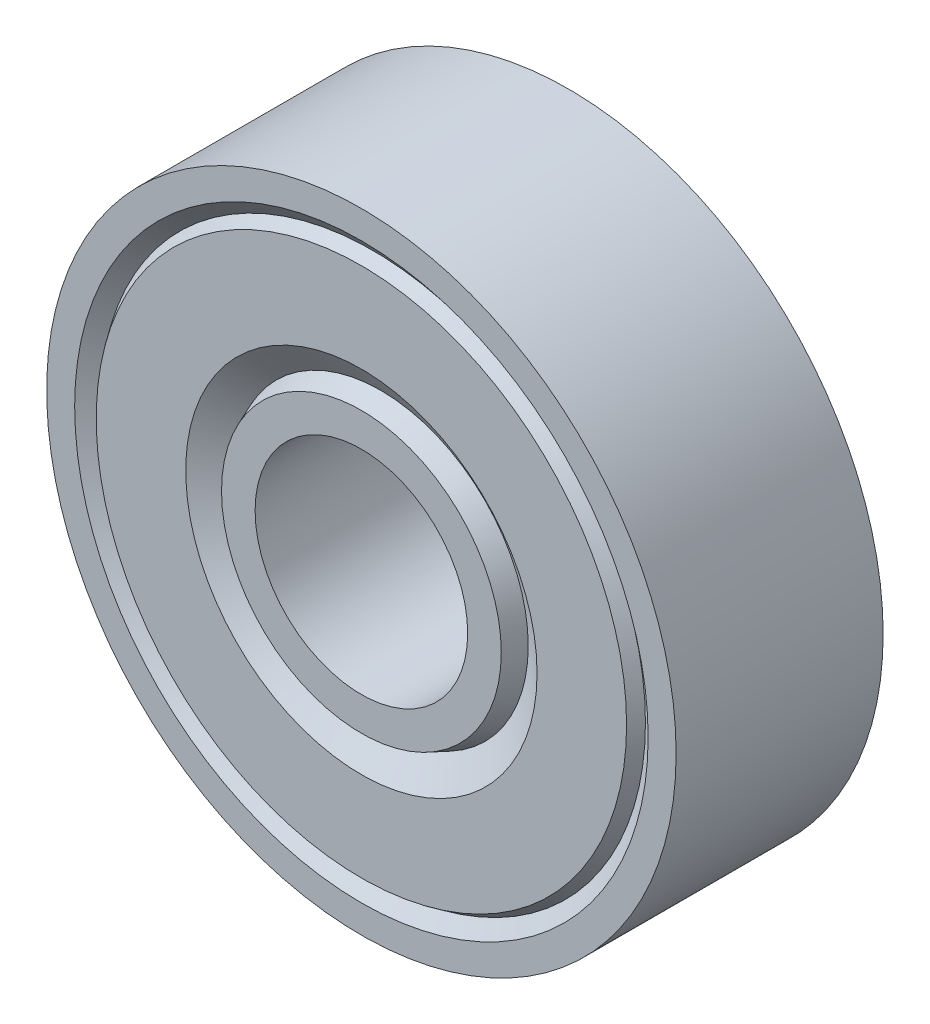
ISO-10303-21;
HEADER;
FILE_DESCRIPTION(('STEP AP214'),'2;1');
FILE_NAME('part.step','',(''),(''),'','','');
FILE_SCHEMA(('AUTOMOTIVE_DESIGN { 1 0 10303 214 1 1 1 1 }'));
ENDSEC;
DATA;
#1=APPLICATION_CONTEXT('core data for automotive mechanical design processes');
#2=APPLICATION_PROTOCOL_DEFINITION('international standard','automotive_design',2000,#1);
#3=PRODUCT_CONTEXT('',#1,'mechanical');
#4=PRODUCT('Part','Part','',(#3));
#5=PRODUCT_RELATED_PRODUCT_CATEGORY('part','',(#4));
#6=PRODUCT_DEFINITION_FORMATION('','',#4);
#7=PRODUCT_DEFINITION_CONTEXT('part definition',#1,'design');
#8=PRODUCT_DEFINITION('design','',#6,#7);
#9=PRODUCT_DEFINITION_SHAPE('','',#8);
#10=(LENGTH_UNIT() NAMED_UNIT(*) SI_UNIT(.MILLI.,.METRE.));
#11=(NAMED_UNIT(*) PLANE_ANGLE_UNIT() SI_UNIT($,.RADIAN.));
#12=(NAMED_UNIT(*) SI_UNIT($,.STERADIAN.) SOLID_ANGLE_UNIT());
#13=UNCERTAINTY_MEASURE_WITH_UNIT(LENGTH_MEASURE(1.E-05),#10,'distance_accuracy_value','');
#14=(GEOMETRIC_REPRESENTATION_CONTEXT(3) GLOBAL_UNCERTAINTY_ASSIGNED_CONTEXT((#13)) GLOBAL_UNIT_ASSIGNED_CONTEXT((#10,
#11,#12)) REPRESENTATION_CONTEXT('',''));
#15=CARTESIAN_POINT('',(0.,0.,0.));
#16=DIRECTION('',(0.,0.,1.));
#17=DIRECTION('',(1.,0.,0.));
#18=AXIS2_PLACEMENT_3D('',#15,#16,#17);
#19=CARTESIAN_POINT('',(0.,0.,0.));
#20=DIRECTION('',(0.,0.,1.));
#21=DIRECTION('',(1.,0.,0.));
#22=AXIS2_PLACEMENT_3D('',#19,#20,#21);
#23=CYLINDRICAL_SURFACE('',#22,4.8259999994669);
#24=CARTESIAN_POINT('',(0.,0.,-4.69899999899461));
#25=DIRECTION('',(0.,0.,1.));
#26=DIRECTION('',(1.,0.,0.));
#27=AXIS2_PLACEMENT_3D('',#24,#25,#26);
#28=CIRCLE('',#27,4.8259999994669);
#29=CARTESIAN_POINT('',(4.8259999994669,0.,-4.69899999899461));
#30=VERTEX_POINT('',#29);
#31=EDGE_CURVE('E82',#30,#30,#28,.T.);
#32=ORIENTED_EDGE('',*,*,#31,.F.);
#33=EDGE_LOOP('',(#32));
#34=FACE_BOUND('',#33,.T.);
#35=CARTESIAN_POINT('',(0.,0.,4.69899999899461));
#36=DIRECTION('',(0.,0.,1.));
#37=DIRECTION('',(1.,0.,0.));
#38=AXIS2_PLACEMENT_3D('',#35,#36,#37);
#39=CIRCLE('',#38,4.8259999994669);
#40=CARTESIAN_POINT('',(4.8259999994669,0.,4.69899999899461));
#41=VERTEX_POINT('',#40);
#42=EDGE_CURVE('E10',#41,#41,#39,.T.);
#43=ORIENTED_EDGE('',*,*,#42,.T.);
#44=EDGE_LOOP('',(#43));
#45=FACE_BOUND('',#44,.T.);
#46=ADVANCED_FACE('F30',(#34,#45),#23,.F.);
#47=CARTESIAN_POINT('',(-6.35000000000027,0.,4.69899999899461));
#48=DIRECTION('',(0.,0.,-1.));
#49=DIRECTION('',(-1.,0.,0.));
#50=AXIS2_PLACEMENT_3D('',#47,#48,#49);
#51=PLANE('',#50);
#52=ORIENTED_EDGE('',*,*,#42,.F.);
#53=EDGE_LOOP('',(#52));
#54=FACE_BOUND('',#53,.T.);
#55=CARTESIAN_POINT('',(0.,0.,4.69899999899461));
#56=DIRECTION('',(0.,0.,1.));
#57=DIRECTION('',(1.,0.,0.));
#58=AXIS2_PLACEMENT_3D('',#55,#56,#57);
#59=CIRCLE('',#58,6.35000000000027);
#60=CARTESIAN_POINT('',(6.35000000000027,0.,4.69899999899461));
#61=VERTEX_POINT('',#60);
#62=EDGE_CURVE('E36',#61,#61,#59,.T.);
#63=ORIENTED_EDGE('',*,*,#62,.T.);
#64=EDGE_LOOP('',(#63));
#65=FACE_BOUND('',#64,.T.);
#66=ADVANCED_FACE('F89',(#54,#65),#51,.F.);
#67=CARTESIAN_POINT('',(0.,0.,3.825839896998));
#68=DIRECTION('',(0.,0.,-1.));
#69=DIRECTION('',(-1.,0.,0.));
#70=AXIS2_PLACEMENT_3D('',#67,#68,#69);
#71=CONICAL_SURFACE('',#70,6.70136220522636,0.382576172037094);
#72=ORIENTED_EDGE('',*,*,#62,.F.);
#73=EDGE_LOOP('',(#72));
#74=FACE_BOUND('',#73,.T.);
#75=CARTESIAN_POINT('',(0.,0.,3.825839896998));
#76=DIRECTION('',(0.,0.,1.));
#77=DIRECTION('',(1.,0.,0.));
#78=AXIS2_PLACEMENT_3D('',#75,#76,#77);
#79=CIRCLE('',#78,6.70136220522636);
#80=CARTESIAN_POINT('',(6.70136220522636,0.,3.825839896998));
#81=VERTEX_POINT('',#80);
#82=EDGE_CURVE('E40',#81,#81,#79,.T.);
#83=ORIENTED_EDGE('',*,*,#82,.T.);
#84=EDGE_LOOP('',(#83));
#85=FACE_BOUND('',#84,.T.);
#86=ADVANCED_FACE('F93',(#74,#85),#71,.T.);
#87=CARTESIAN_POINT('',(0.,0.,4.69899999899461));
#88=DIRECTION('',(0.,0.,1.));
#89=DIRECTION('',(1.,0.,0.));
#90=AXIS2_PLACEMENT_3D('',#87,#88,#89);
#91=CONICAL_SURFACE('',#90,7.97467252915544,0.969704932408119);
#92=ORIENTED_EDGE('',*,*,#82,.F.);
#93=EDGE_LOOP('',(#92));
#94=FACE_BOUND('',#93,.T.);
#95=CARTESIAN_POINT('',(0.,0.,4.69899999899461));
#96=DIRECTION('',(0.,0.,1.));
#97=DIRECTION('',(1.,0.,0.));
#98=AXIS2_PLACEMENT_3D('',#95,#96,#97);
#99=CIRCLE('',#98,7.97467252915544);
#100=CARTESIAN_POINT('',(7.97467252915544,0.,4.69899999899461));
#101=VERTEX_POINT('',#100);
#102=EDGE_CURVE('E44',#101,#101,#99,.T.);
#103=ORIENTED_EDGE('',*,*,#102,.T.);
#104=EDGE_LOOP('',(#103));
#105=FACE_BOUND('',#104,.T.);
#106=ADVANCED_FACE('F98',(#94,#105),#91,.F.);
#107=CARTESIAN_POINT('',(-12.0386725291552,0.,4.69899999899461));
#108=DIRECTION('',(0.,0.,-1.));
#109=DIRECTION('',(-1.,0.,0.));
#110=AXIS2_PLACEMENT_3D('',#107,#108,#109);
#111=PLANE('',#110);
#112=ORIENTED_EDGE('',*,*,#102,.F.);
#113=EDGE_LOOP('',(#112));
#114=FACE_BOUND('',#113,.T.);
#115=CARTESIAN_POINT('',(0.,0.,4.69899999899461));
#116=DIRECTION('',(0.,0.,1.));
#117=DIRECTION('',(1.,0.,0.));
#118=AXIS2_PLACEMENT_3D('',#115,#116,#117);
#119=CIRCLE('',#118,12.0386725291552);
#120=CARTESIAN_POINT('',(12.0386725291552,0.,4.69899999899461));
#121=VERTEX_POINT('',#120);
#122=EDGE_CURVE('E49',#121,#121,#119,.T.);
#123=ORIENTED_EDGE('',*,*,#122,.T.);
#124=EDGE_LOOP('',(#123));
#125=FACE_BOUND('',#124,.T.);
#126=ADVANCED_FACE('F104',(#114,#125),#111,.F.);
#127=CARTESIAN_POINT('',(0.,0.,4.19099999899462));
#128=DIRECTION('',(0.,0.,-1.));
#129=DIRECTION('',(-1.,0.,0.));
#130=AXIS2_PLACEMENT_3D('',#127,#128,#129);
#131=CONICAL_SURFACE('',#130,12.3870285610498,0.601091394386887);
#132=ORIENTED_EDGE('',*,*,#122,.F.);
#133=EDGE_LOOP('',(#132));
#134=FACE_BOUND('',#133,.T.);
#135=CARTESIAN_POINT('',(0.,0.,4.19099999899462));
#136=DIRECTION('',(0.,0.,1.));
#137=DIRECTION('',(1.,0.,0.));
#138=AXIS2_PLACEMENT_3D('',#135,#136,#137);
#139=CIRCLE('',#138,12.3870285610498);
#140=CARTESIAN_POINT('',(12.3870285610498,0.,4.19099999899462));
#141=VERTEX_POINT('',#140);
#142=EDGE_CURVE('E52',#141,#141,#139,.T.);
#143=ORIENTED_EDGE('',*,*,#142,.T.);
#144=EDGE_LOOP('',(#143));
#145=FACE_BOUND('',#144,.T.);
#146=ADVANCED_FACE('F108',(#134,#145),#131,.T.);
#147=CARTESIAN_POINT('',(0.,0.,4.69899999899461));
#148=DIRECTION('',(0.,0.,1.));
#149=DIRECTION('',(1.,0.,0.));
#150=AXIS2_PLACEMENT_3D('',#147,#148,#149);
#151=CONICAL_SURFACE('',#150,13.0174999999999,0.892561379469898);
#152=ORIENTED_EDGE('',*,*,#142,.F.);
#153=EDGE_LOOP('',(#152));
#154=FACE_BOUND('',#153,.T.);
#155=CARTESIAN_POINT('',(0.,0.,4.69899999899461));
#156=DIRECTION('',(0.,0.,1.));
#157=DIRECTION('',(1.,0.,0.));
#158=AXIS2_PLACEMENT_3D('',#155,#156,#157);
#159=CIRCLE('',#158,13.0174999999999);
#160=CARTESIAN_POINT('',(13.0174999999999,0.,4.69899999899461));
#161=VERTEX_POINT('',#160);
#162=EDGE_CURVE('E55',#161,#161,#159,.T.);
#163=ORIENTED_EDGE('',*,*,#162,.T.);
#164=EDGE_LOOP('',(#163));
#165=FACE_BOUND('',#164,.T.);
#166=ADVANCED_FACE('F112',(#154,#165),#151,.F.);
#167=CARTESIAN_POINT('',(-14.2875,0.,4.69899999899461));
#168=DIRECTION('',(0.,0.,-1.));
#169=DIRECTION('',(-1.,0.,0.));
#170=AXIS2_PLACEMENT_3D('',#167,#168,#169);
#171=PLANE('',#170);
#172=ORIENTED_EDGE('',*,*,#162,.F.);
#173=EDGE_LOOP('',(#172));
#174=FACE_BOUND('',#173,.T.);
#175=CARTESIAN_POINT('',(0.,0.,4.69899999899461));
#176=DIRECTION('',(0.,0.,1.));
#177=DIRECTION('',(1.,0.,0.));
#178=AXIS2_PLACEMENT_3D('',#175,#176,#177);
#179=CIRCLE('',#178,14.2875);
#180=CARTESIAN_POINT('',(14.2875,0.,4.69899999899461));
#181=VERTEX_POINT('',#180);
#182=EDGE_CURVE('E58',#181,#181,#179,.T.);
#183=ORIENTED_EDGE('',*,*,#182,.T.);
#184=EDGE_LOOP('',(#183));
#185=FACE_BOUND('',#184,.T.);
#186=ADVANCED_FACE('F116',(#174,#185),#171,.F.);
#187=CARTESIAN_POINT('',(0.,0.,0.));
#188=DIRECTION('',(0.,0.,1.));
#189=DIRECTION('',(1.,0.,0.));
#190=AXIS2_PLACEMENT_3D('',#187,#188,#189);
#191=CYLINDRICAL_SURFACE('',#190,14.2875);
#192=ORIENTED_EDGE('',*,*,#182,.F.);
#193=EDGE_LOOP('',(#192));
#194=FACE_BOUND('',#193,.T.);
#195=CARTESIAN_POINT('',(0.,0.,-4.69899999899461));
#196=DIRECTION('',(0.,0.,1.));
#197=DIRECTION('',(1.,0.,0.));
#198=AXIS2_PLACEMENT_3D('',#195,#196,#197);
#199=CIRCLE('',#198,14.2875);
#200=CARTESIAN_POINT('',(14.2875,0.,-4.69899999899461));
#201=VERTEX_POINT('',#200);
#202=EDGE_CURVE('E61',#201,#201,#199,.T.);
#203=ORIENTED_EDGE('',*,*,#202,.T.);
#204=EDGE_LOOP('',(#203));
#205=FACE_BOUND('',#204,.T.);
#206=ADVANCED_FACE('F120',(#194,#205),#191,.T.);
#207=CARTESIAN_POINT('',(-14.2875,0.,-4.69899999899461));
#208=DIRECTION('',(0.,0.,1.));
#209=DIRECTION('',(1.,0.,0.));
#210=AXIS2_PLACEMENT_3D('',#207,#208,#209);
#211=PLANE('',#210);
#212=ORIENTED_EDGE('',*,*,#202,.F.);
#213=EDGE_LOOP('',(#212));
#214=FACE_BOUND('',#213,.T.);
#215=CARTESIAN_POINT('',(0.,0.,-4.69899999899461));
#216=DIRECTION('',(0.,0.,1.));
#217=DIRECTION('',(1.,0.,0.));
#218=AXIS2_PLACEMENT_3D('',#215,#216,#217);
#219=CIRCLE('',#218,13.0174999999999);
#220=CARTESIAN_POINT('',(13.0174999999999,0.,-4.69899999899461));
#221=VERTEX_POINT('',#220);
#222=EDGE_CURVE('E64',#221,#221,#219,.T.);
#223=ORIENTED_EDGE('',*,*,#222,.T.);
#224=EDGE_LOOP('',(#223));
#225=FACE_BOUND('',#224,.T.);
#226=ADVANCED_FACE('F124',(#214,#225),#211,.F.);
#227=CARTESIAN_POINT('',(0.,0.,-4.19099999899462));
#228=DIRECTION('',(0.,0.,-1.));
#229=DIRECTION('',(-1.,0.,0.));
#230=AXIS2_PLACEMENT_3D('',#227,#228,#229);
#231=CONICAL_SURFACE('',#230,12.3870285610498,0.892561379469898);
#232=ORIENTED_EDGE('',*,*,#222,.F.);
#233=EDGE_LOOP('',(#232));
#234=FACE_BOUND('',#233,.T.);
#235=CARTESIAN_POINT('',(0.,0.,-4.19099999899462));
#236=DIRECTION('',(0.,0.,1.));
#237=DIRECTION('',(1.,0.,0.));
#238=AXIS2_PLACEMENT_3D('',#235,#236,#237);
#239=CIRCLE('',#238,12.3870285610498);
#240=CARTESIAN_POINT('',(12.3870285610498,0.,-4.19099999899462));
#241=VERTEX_POINT('',#240);
#242=EDGE_CURVE('E67',#241,#241,#239,.T.);
#243=ORIENTED_EDGE('',*,*,#242,.T.);
#244=EDGE_LOOP('',(#243));
#245=FACE_BOUND('',#244,.T.);
#246=ADVANCED_FACE('F128',(#234,#245),#231,.F.);
#247=CARTESIAN_POINT('',(0.,0.,-4.69899999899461));
#248=DIRECTION('',(0.,0.,1.));
#249=DIRECTION('',(1.,0.,0.));
#250=AXIS2_PLACEMENT_3D('',#247,#248,#249);
#251=CONICAL_SURFACE('',#250,12.0386725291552,0.601091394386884);
#252=ORIENTED_EDGE('',*,*,#242,.F.);
#253=EDGE_LOOP('',(#252));
#254=FACE_BOUND('',#253,.T.);
#255=CARTESIAN_POINT('',(0.,0.,-4.69899999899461));
#256=DIRECTION('',(0.,0.,1.));
#257=DIRECTION('',(1.,0.,0.));
#258=AXIS2_PLACEMENT_3D('',#255,#256,#257);
#259=CIRCLE('',#258,12.0386725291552);
#260=CARTESIAN_POINT('',(12.0386725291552,0.,-4.69899999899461));
#261=VERTEX_POINT('',#260);
#262=EDGE_CURVE('E70',#261,#261,#259,.T.);
#263=ORIENTED_EDGE('',*,*,#262,.T.);
#264=EDGE_LOOP('',(#263));
#265=FACE_BOUND('',#264,.T.);
#266=ADVANCED_FACE('F132',(#254,#265),#251,.T.);
#267=CARTESIAN_POINT('',(-12.0386725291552,0.,-4.69899999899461));
#268=DIRECTION('',(0.,0.,1.));
#269=DIRECTION('',(1.,0.,0.));
#270=AXIS2_PLACEMENT_3D('',#267,#268,#269);
#271=PLANE('',#270);
#272=ORIENTED_EDGE('',*,*,#262,.F.);
#273=EDGE_LOOP('',(#272));
#274=FACE_BOUND('',#273,.T.);
#275=CARTESIAN_POINT('',(0.,0.,-4.69899999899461));
#276=DIRECTION('',(0.,0.,1.));
#277=DIRECTION('',(1.,0.,0.));
#278=AXIS2_PLACEMENT_3D('',#275,#276,#277);
#279=CIRCLE('',#278,7.97467252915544);
#280=CARTESIAN_POINT('',(7.97467252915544,0.,-4.69899999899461));
#281=VERTEX_POINT('',#280);
#282=EDGE_CURVE('E73',#281,#281,#279,.T.);
#283=ORIENTED_EDGE('',*,*,#282,.T.);
#284=EDGE_LOOP('',(#283));
#285=FACE_BOUND('',#284,.T.);
#286=ADVANCED_FACE('F136',(#274,#285),#271,.F.);
#287=CARTESIAN_POINT('',(0.,0.,-3.825839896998));
#288=DIRECTION('',(0.,0.,-1.));
#289=DIRECTION('',(-1.,0.,0.));
#290=AXIS2_PLACEMENT_3D('',#287,#288,#289);
#291=CONICAL_SURFACE('',#290,6.70136220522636,0.969704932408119);
#292=ORIENTED_EDGE('',*,*,#282,.F.);
#293=EDGE_LOOP('',(#292));
#294=FACE_BOUND('',#293,.T.);
#295=CARTESIAN_POINT('',(0.,0.,-3.825839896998));
#296=DIRECTION('',(0.,0.,1.));
#297=DIRECTION('',(1.,0.,0.));
#298=AXIS2_PLACEMENT_3D('',#295,#296,#297);
#299=CIRCLE('',#298,6.70136220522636);
#300=CARTESIAN_POINT('',(6.70136220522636,0.,-3.825839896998));
#301=VERTEX_POINT('',#300);
#302=EDGE_CURVE('E76',#301,#301,#299,.T.);
#303=ORIENTED_EDGE('',*,*,#302,.T.);
#304=EDGE_LOOP('',(#303));
#305=FACE_BOUND('',#304,.T.);
#306=ADVANCED_FACE('F140',(#294,#305),#291,.F.);
#307=CARTESIAN_POINT('',(0.,0.,-4.69899999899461));
#308=DIRECTION('',(0.,0.,1.));
#309=DIRECTION('',(1.,0.,0.));
#310=AXIS2_PLACEMENT_3D('',#307,#308,#309);
#311=CONICAL_SURFACE('',#310,6.35000000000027,0.382576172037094);
#312=ORIENTED_EDGE('',*,*,#302,.F.);
#313=EDGE_LOOP('',(#312));
#314=FACE_BOUND('',#313,.T.);
#315=CARTESIAN_POINT('',(0.,0.,-4.69899999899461));
#316=DIRECTION('',(0.,0.,1.));
#317=DIRECTION('',(1.,0.,0.));
#318=AXIS2_PLACEMENT_3D('',#315,#316,#317);
#319=CIRCLE('',#318,6.35000000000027);
#320=CARTESIAN_POINT('',(6.35000000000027,0.,-4.69899999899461));
#321=VERTEX_POINT('',#320);
#322=EDGE_CURVE('E79',#321,#321,#319,.T.);
#323=ORIENTED_EDGE('',*,*,#322,.T.);
#324=EDGE_LOOP('',(#323));
#325=FACE_BOUND('',#324,.T.);
#326=ADVANCED_FACE('F144',(#314,#325),#311,.T.);
#327=CARTESIAN_POINT('',(-6.35000000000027,0.,-4.69899999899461));
#328=DIRECTION('',(0.,0.,1.));
#329=DIRECTION('',(1.,0.,0.));
#330=AXIS2_PLACEMENT_3D('',#327,#328,#329);
#331=PLANE('',#330);
#332=ORIENTED_EDGE('',*,*,#322,.F.);
#333=EDGE_LOOP('',(#332));
#334=FACE_BOUND('',#333,.T.);
#335=ORIENTED_EDGE('',*,*,#31,.T.);
#336=EDGE_LOOP('',(#335));
#337=FACE_BOUND('',#336,.T.);
#338=ADVANCED_FACE('F86',(#334,#337),#331,.F.);
#339=CLOSED_SHELL('',(#46,#66,#86,#106,#126,#146,#166,#186,#206,#226,#246,#266,#286,#306,#326,#338));
#340=MANIFOLD_SOLID_BREP('B2',#339);
#341=ADVANCED_BREP_SHAPE_REPRESENTATION('',(#18,#340),#14);
#342=SHAPE_DEFINITION_REPRESENTATION(#9,#341);
ENDSEC;
END-ISO-10303-21;
